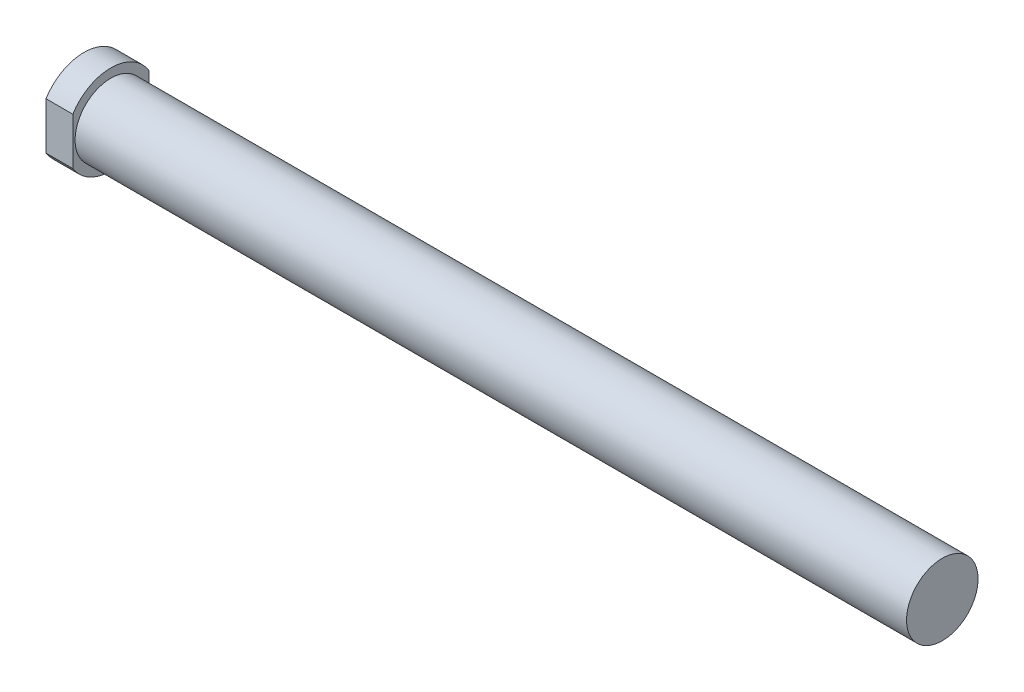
from build123d import *

# Parameters (mm, degrees)
ESQUISSE2_OUTSIDE_W     = 60.814
ESQUISSE2_OUTSIDE_H     = 60.814
ESQUISSE2_OUTSIDE_W_2   = 17
ESQUISSE2_OUTSIDE_H_2   = 21.440972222
ENL_V_MAT_EXTRU_1_DEPTH = 6


with BuildPart() as part:
    # Esquisse1 → R_volution1 (revolve)
    with BuildSketch(Plane.XY, mode=Mode.PRIVATE) as r_volution1_sk:
        Polygon((0, 0), (0, 10), (6, 10), (6, 8), (192, 8), (192, 0), align=None)
    revolve(r_volution1_sk.sketch.rotate(Axis((0, 0, 0), (1, 0, 0)), 90), axis=Axis((0, 0, 0), (1, 0, 0)))

    # Esquisse2 outside → Enl_v. mat.-Extru.1 (cut)
    with BuildSketch(Plane.ZY):
        Rectangle(ESQUISSE2_OUTSIDE_W, ESQUISSE2_OUTSIDE_H)
        with Locations((0, -0.072337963)):
            Rectangle(ESQUISSE2_OUTSIDE_W_2, ESQUISSE2_OUTSIDE_H_2, mode=Mode.SUBTRACT)
    extrude(amount=-ENL_V_MAT_EXTRU_1_DEPTH, mode=Mode.SUBTRACT)


solid = part.part
